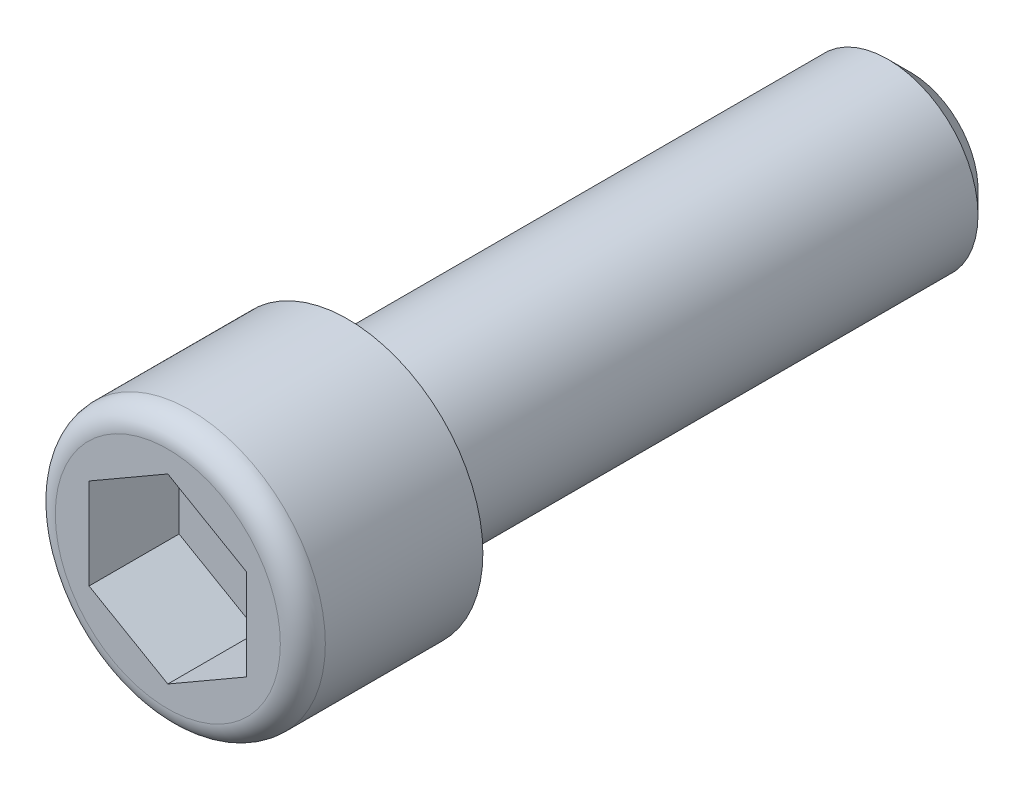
ISO-10303-21;
HEADER;
FILE_DESCRIPTION(('STEP AP214'),'2;1');
FILE_NAME('part.step','',(''),(''),'','','');
FILE_SCHEMA(('AUTOMOTIVE_DESIGN { 1 0 10303 214 1 1 1 1 }'));
ENDSEC;
DATA;
#1=APPLICATION_CONTEXT('core data for automotive mechanical design processes');
#2=APPLICATION_PROTOCOL_DEFINITION('international standard','automotive_design',2000,#1);
#3=PRODUCT_CONTEXT('',#1,'mechanical');
#4=PRODUCT('Part','Part','',(#3));
#5=PRODUCT_RELATED_PRODUCT_CATEGORY('part','',(#4));
#6=PRODUCT_DEFINITION_FORMATION('','',#4);
#7=PRODUCT_DEFINITION_CONTEXT('part definition',#1,'design');
#8=PRODUCT_DEFINITION('design','',#6,#7);
#9=PRODUCT_DEFINITION_SHAPE('','',#8);
#10=(LENGTH_UNIT() NAMED_UNIT(*) SI_UNIT(.MILLI.,.METRE.));
#11=(NAMED_UNIT(*) PLANE_ANGLE_UNIT() SI_UNIT($,.RADIAN.));
#12=(NAMED_UNIT(*) SI_UNIT($,.STERADIAN.) SOLID_ANGLE_UNIT());
#13=UNCERTAINTY_MEASURE_WITH_UNIT(LENGTH_MEASURE(1.E-05),#10,'distance_accuracy_value','');
#14=(GEOMETRIC_REPRESENTATION_CONTEXT(3) GLOBAL_UNCERTAINTY_ASSIGNED_CONTEXT((#13)) GLOBAL_UNIT_ASSIGNED_CONTEXT((#10,
#11,#12)) REPRESENTATION_CONTEXT('',''));
#15=CARTESIAN_POINT('',(0.,0.,0.));
#16=DIRECTION('',(0.,0.,1.));
#17=DIRECTION('',(1.,0.,0.));
#18=AXIS2_PLACEMENT_3D('',#15,#16,#17);
#19=CARTESIAN_POINT('',(0.,0.,-8.));
#20=DIRECTION('',(0.,0.,1.));
#21=DIRECTION('',(1.,0.,0.));
#22=AXIS2_PLACEMENT_3D('',#19,#20,#21);
#23=PLANE('',#22);
#24=CARTESIAN_POINT('',(0.,0.,-8.));
#25=DIRECTION('',(0.,0.,1.));
#26=DIRECTION('',(1.,0.,0.));
#27=AXIS2_PLACEMENT_3D('',#24,#25,#26);
#28=CIRCLE('',#27,6.);
#29=CARTESIAN_POINT('',(6.,0.,-8.));
#30=VERTEX_POINT('',#29);
#31=EDGE_CURVE('E134',#30,#30,#28,.T.);
#32=ORIENTED_EDGE('',*,*,#31,.F.);
#33=EDGE_LOOP('',(#32));
#34=FACE_BOUND('',#33,.T.);
#35=CARTESIAN_POINT('',(0.,0.,-8.));
#36=DIRECTION('',(0.,0.,1.));
#37=DIRECTION('',(1.,0.,0.));
#38=AXIS2_PLACEMENT_3D('',#35,#36,#37);
#39=CIRCLE('',#38,4.);
#40=CARTESIAN_POINT('',(4.,0.,-8.));
#41=VERTEX_POINT('',#40);
#42=EDGE_CURVE('E142',#41,#41,#39,.F.);
#43=ORIENTED_EDGE('',*,*,#42,.F.);
#44=EDGE_LOOP('',(#43));
#45=FACE_BOUND('',#44,.T.);
#46=ADVANCED_FACE('F32',(#34,#45),#23,.F.);
#47=CARTESIAN_POINT('',(0.,0.,-8.));
#48=DIRECTION('',(0.,0.,1.));
#49=DIRECTION('',(1.,0.,0.));
#50=AXIS2_PLACEMENT_3D('',#47,#48,#49);
#51=CYLINDRICAL_SURFACE('',#50,6.);
#52=CARTESIAN_POINT('',(0.,0.,-1.));
#53=DIRECTION('',(0.,0.,1.));
#54=DIRECTION('',(1.,0.,0.));
#55=AXIS2_PLACEMENT_3D('',#52,#53,#54);
#56=CIRCLE('',#55,6.);
#57=CARTESIAN_POINT('',(6.,0.,-1.));
#58=VERTEX_POINT('',#57);
#59=EDGE_CURVE('E11',#58,#58,#56,.F.);
#60=ORIENTED_EDGE('',*,*,#59,.T.);
#61=EDGE_LOOP('',(#60));
#62=FACE_BOUND('',#61,.T.);
#63=ORIENTED_EDGE('',*,*,#31,.T.);
#64=EDGE_LOOP('',(#63));
#65=FACE_BOUND('',#64,.T.);
#66=ADVANCED_FACE('F165',(#62,#65),#51,.T.);
#67=CARTESIAN_POINT('',(0.,0.,0.));
#68=DIRECTION('',(0.,0.,1.));
#69=DIRECTION('',(1.,0.,0.));
#70=AXIS2_PLACEMENT_3D('',#67,#68,#69);
#71=PLANE('',#70);
#72=CARTESIAN_POINT('',(0.,0.,0.));
#73=DIRECTION('',(0.,0.,1.));
#74=DIRECTION('',(1.,0.,0.));
#75=AXIS2_PLACEMENT_3D('',#72,#73,#74);
#76=CIRCLE('',#75,5.);
#77=CARTESIAN_POINT('',(5.,0.,0.));
#78=VERTEX_POINT('',#77);
#79=EDGE_CURVE('E40',#78,#78,#76,.T.);
#80=ORIENTED_EDGE('',*,*,#79,.T.);
#81=EDGE_LOOP('',(#80));
#82=FACE_BOUND('',#81,.T.);
#83=DIRECTION('',(0.,-1.,0.));
#84=VECTOR('',#83,1.);
#85=CARTESIAN_POINT('',(-3.5,2.02072594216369,0.));
#86=LINE('',#85,#84);
#87=CARTESIAN_POINT('',(-3.5,2.02072594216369,0.));
#88=VERTEX_POINT('',#87);
#89=CARTESIAN_POINT('',(-3.5,-2.02072594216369,0.));
#90=VERTEX_POINT('',#89);
#91=EDGE_CURVE('E47',#88,#90,#86,.T.);
#92=ORIENTED_EDGE('',*,*,#91,.F.);
#93=DIRECTION('',(-0.866025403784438,-0.5,0.));
#94=VECTOR('',#93,1.);
#95=CARTESIAN_POINT('',(0.,4.04145188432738,0.));
#96=LINE('',#95,#94);
#97=CARTESIAN_POINT('',(0.,4.04145188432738,0.));
#98=VERTEX_POINT('',#97);
#99=EDGE_CURVE('E130',#98,#88,#96,.T.);
#100=ORIENTED_EDGE('',*,*,#99,.F.);
#101=DIRECTION('',(-0.866025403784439,0.5,0.));
#102=VECTOR('',#101,1.);
#103=CARTESIAN_POINT('',(3.5,2.02072594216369,0.));
#104=LINE('',#103,#102);
#105=CARTESIAN_POINT('',(3.5,2.02072594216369,0.));
#106=VERTEX_POINT('',#105);
#107=EDGE_CURVE('E128',#106,#98,#104,.T.);
#108=ORIENTED_EDGE('',*,*,#107,.F.);
#109=DIRECTION('',(0.,1.,0.));
#110=VECTOR('',#109,1.);
#111=CARTESIAN_POINT('',(3.5,-2.02072594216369,0.));
#112=LINE('',#111,#110);
#113=CARTESIAN_POINT('',(3.5,-2.02072594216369,0.));
#114=VERTEX_POINT('',#113);
#115=EDGE_CURVE('E95',#114,#106,#112,.T.);
#116=ORIENTED_EDGE('',*,*,#115,.F.);
#117=DIRECTION('',(0.866025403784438,0.5,0.));
#118=VECTOR('',#117,1.);
#119=CARTESIAN_POINT('',(0.,-4.04145188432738,0.));
#120=LINE('',#119,#118);
#121=CARTESIAN_POINT('',(0.,-4.04145188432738,0.));
#122=VERTEX_POINT('',#121);
#123=EDGE_CURVE('E124',#122,#114,#120,.T.);
#124=ORIENTED_EDGE('',*,*,#123,.F.);
#125=DIRECTION('',(0.866025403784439,-0.5,0.));
#126=VECTOR('',#125,1.);
#127=CARTESIAN_POINT('',(-3.5,-2.02072594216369,0.));
#128=LINE('',#127,#126);
#129=EDGE_CURVE('E121',#90,#122,#128,.T.);
#130=ORIENTED_EDGE('',*,*,#129,.F.);
#131=EDGE_LOOP('',(#92,#100,#108,#116,#124,#130));
#132=FACE_BOUND('',#131,.T.);
#133=ADVANCED_FACE('F153',(#82,#132),#71,.T.);
#134=CARTESIAN_POINT('',(0.,0.,-33.));
#135=DIRECTION('',(0.,0.,1.));
#136=DIRECTION('',(1.,0.,0.));
#137=AXIS2_PLACEMENT_3D('',#134,#135,#136);
#138=CYLINDRICAL_SURFACE('',#137,4.);
#139=CARTESIAN_POINT('',(0.,0.,-32.));
#140=DIRECTION('',(0.,0.,-1.));
#141=DIRECTION('',(-1.,0.,0.));
#142=AXIS2_PLACEMENT_3D('',#139,#140,#141);
#143=CIRCLE('',#142,4.);
#144=CARTESIAN_POINT('',(-4.,0.,-32.));
#145=VERTEX_POINT('',#144);
#146=EDGE_CURVE('E148',#145,#145,#143,.F.);
#147=ORIENTED_EDGE('',*,*,#146,.T.);
#148=EDGE_LOOP('',(#147));
#149=FACE_BOUND('',#148,.T.);
#150=ORIENTED_EDGE('',*,*,#42,.T.);
#151=EDGE_LOOP('',(#150));
#152=FACE_BOUND('',#151,.T.);
#153=ADVANCED_FACE('F177',(#149,#152),#138,.T.);
#154=CARTESIAN_POINT('',(0.,0.,-33.));
#155=DIRECTION('',(0.,0.,-1.));
#156=DIRECTION('',(-1.,0.,0.));
#157=AXIS2_PLACEMENT_3D('',#154,#155,#156);
#158=PLANE('',#157);
#159=CARTESIAN_POINT('',(0.,0.,-33.));
#160=DIRECTION('',(0.,0.,-1.));
#161=DIRECTION('',(-1.,0.,0.));
#162=AXIS2_PLACEMENT_3D('',#159,#160,#161);
#163=CIRCLE('',#162,3.);
#164=CARTESIAN_POINT('',(-3.,0.,-33.));
#165=VERTEX_POINT('',#164);
#166=EDGE_CURVE('E145',#165,#165,#163,.T.);
#167=ORIENTED_EDGE('',*,*,#166,.T.);
#168=EDGE_LOOP('',(#167));
#169=FACE_BOUND('',#168,.T.);
#170=ADVANCED_FACE('F183',(#169),#158,.T.);
#171=CARTESIAN_POINT('',(0.,0.,-33.));
#172=DIRECTION('',(0.,0.,1.));
#173=DIRECTION('',(1.,0.,0.));
#174=AXIS2_PLACEMENT_3D('',#171,#172,#173);
#175=CONICAL_SURFACE('',#174,3.,0.785398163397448);
#176=ORIENTED_EDGE('',*,*,#146,.F.);
#177=EDGE_LOOP('',(#176));
#178=FACE_BOUND('',#177,.T.);
#179=ORIENTED_EDGE('',*,*,#166,.F.);
#180=EDGE_LOOP('',(#179));
#181=FACE_BOUND('',#180,.T.);
#182=ADVANCED_FACE('F180',(#178,#181),#175,.T.);
#183=CARTESIAN_POINT('',(-3.5,2.02072594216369,-4.));
#184=DIRECTION('',(-1.,0.,0.));
#185=DIRECTION('',(0.,-1.,0.));
#186=AXIS2_PLACEMENT_3D('',#183,#184,#185);
#187=PLANE('',#186);
#188=ORIENTED_EDGE('',*,*,#91,.T.);
#189=DIRECTION('',(0.,0.,1.));
#190=VECTOR('',#189,1.);
#191=CARTESIAN_POINT('',(-3.5,-2.02072594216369,-4.));
#192=LINE('',#191,#190);
#193=CARTESIAN_POINT('',(-3.5,-2.02072594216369,-4.));
#194=VERTEX_POINT('',#193);
#195=EDGE_CURVE('E77',#194,#90,#192,.T.);
#196=ORIENTED_EDGE('',*,*,#195,.F.);
#197=DIRECTION('',(0.,-1.,0.));
#198=VECTOR('',#197,1.);
#199=CARTESIAN_POINT('',(-3.5,2.02072594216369,-4.));
#200=LINE('',#199,#198);
#201=CARTESIAN_POINT('',(-3.5,2.02072594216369,-4.));
#202=VERTEX_POINT('',#201);
#203=EDGE_CURVE('E132',#202,#194,#200,.T.);
#204=ORIENTED_EDGE('',*,*,#203,.F.);
#205=DIRECTION('',(0.,0.,1.));
#206=VECTOR('',#205,1.);
#207=CARTESIAN_POINT('',(-3.5,2.02072594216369,-4.));
#208=LINE('',#207,#206);
#209=EDGE_CURVE('E55',#202,#88,#208,.T.);
#210=ORIENTED_EDGE('',*,*,#209,.T.);
#211=EDGE_LOOP('',(#188,#196,#204,#210));
#212=FACE_BOUND('',#211,.T.);
#213=ADVANCED_FACE('F182',(#212),#187,.F.);
#214=CARTESIAN_POINT('',(0.,4.04145188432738,-4.));
#215=DIRECTION('',(-0.5,0.866025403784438,0.));
#216=DIRECTION('',(-0.866025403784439,-0.5,0.));
#217=AXIS2_PLACEMENT_3D('',#214,#215,#216);
#218=PLANE('',#217);
#219=ORIENTED_EDGE('',*,*,#99,.T.);
#220=ORIENTED_EDGE('',*,*,#209,.F.);
#221=DIRECTION('',(-0.866025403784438,-0.5,0.));
#222=VECTOR('',#221,1.);
#223=CARTESIAN_POINT('',(0.,4.04145188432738,-4.));
#224=LINE('',#223,#222);
#225=CARTESIAN_POINT('',(0.,4.04145188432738,-4.));
#226=VERTEX_POINT('',#225);
#227=EDGE_CURVE('E107',#226,#202,#224,.T.);
#228=ORIENTED_EDGE('',*,*,#227,.F.);
#229=DIRECTION('',(0.,0.,1.));
#230=VECTOR('',#229,1.);
#231=CARTESIAN_POINT('',(0.,4.04145188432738,-4.));
#232=LINE('',#231,#230);
#233=EDGE_CURVE('E99',#226,#98,#232,.T.);
#234=ORIENTED_EDGE('',*,*,#233,.T.);
#235=EDGE_LOOP('',(#219,#220,#228,#234));
#236=FACE_BOUND('',#235,.T.);
#237=ADVANCED_FACE('F189',(#236),#218,.F.);
#238=CARTESIAN_POINT('',(3.5,2.02072594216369,-4.));
#239=DIRECTION('',(0.5,0.866025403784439,0.));
#240=DIRECTION('',(-0.866025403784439,0.5,0.));
#241=AXIS2_PLACEMENT_3D('',#238,#239,#240);
#242=PLANE('',#241);
#243=ORIENTED_EDGE('',*,*,#107,.T.);
#244=ORIENTED_EDGE('',*,*,#233,.F.);
#245=DIRECTION('',(-0.866025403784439,0.5,0.));
#246=VECTOR('',#245,1.);
#247=CARTESIAN_POINT('',(3.5,2.02072594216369,-4.));
#248=LINE('',#247,#246);
#249=CARTESIAN_POINT('',(3.5,2.02072594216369,-4.));
#250=VERTEX_POINT('',#249);
#251=EDGE_CURVE('E103',#250,#226,#248,.T.);
#252=ORIENTED_EDGE('',*,*,#251,.F.);
#253=DIRECTION('',(0.,0.,1.));
#254=VECTOR('',#253,1.);
#255=CARTESIAN_POINT('',(3.5,2.02072594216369,-4.));
#256=LINE('',#255,#254);
#257=EDGE_CURVE('E88',#250,#106,#256,.T.);
#258=ORIENTED_EDGE('',*,*,#257,.T.);
#259=EDGE_LOOP('',(#243,#244,#252,#258));
#260=FACE_BOUND('',#259,.T.);
#261=ADVANCED_FACE('F104',(#260),#242,.F.);
#262=CARTESIAN_POINT('',(3.5,-2.02072594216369,-4.));
#263=DIRECTION('',(1.,0.,0.));
#264=DIRECTION('',(0.,0.,-1.));
#265=AXIS2_PLACEMENT_3D('',#262,#263,#264);
#266=PLANE('',#265);
#267=ORIENTED_EDGE('',*,*,#115,.T.);
#268=ORIENTED_EDGE('',*,*,#257,.F.);
#269=DIRECTION('',(0.,1.,0.));
#270=VECTOR('',#269,1.);
#271=CARTESIAN_POINT('',(3.5,-2.02072594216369,-4.));
#272=LINE('',#271,#270);
#273=CARTESIAN_POINT('',(3.5,-2.02072594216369,-4.));
#274=VERTEX_POINT('',#273);
#275=EDGE_CURVE('E92',#274,#250,#272,.T.);
#276=ORIENTED_EDGE('',*,*,#275,.F.);
#277=DIRECTION('',(0.,0.,1.));
#278=VECTOR('',#277,1.);
#279=CARTESIAN_POINT('',(3.5,-2.02072594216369,-4.));
#280=LINE('',#279,#278);
#281=EDGE_CURVE('E100',#274,#114,#280,.T.);
#282=ORIENTED_EDGE('',*,*,#281,.T.);
#283=EDGE_LOOP('',(#267,#268,#276,#282));
#284=FACE_BOUND('',#283,.T.);
#285=ADVANCED_FACE('F90',(#284),#266,.F.);
#286=CARTESIAN_POINT('',(0.,-4.04145188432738,-4.));
#287=DIRECTION('',(0.5,-0.866025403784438,0.));
#288=DIRECTION('',(0.866025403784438,0.5,0.));
#289=AXIS2_PLACEMENT_3D('',#286,#287,#288);
#290=PLANE('',#289);
#291=ORIENTED_EDGE('',*,*,#123,.T.);
#292=ORIENTED_EDGE('',*,*,#281,.F.);
#293=DIRECTION('',(0.866025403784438,0.5,0.));
#294=VECTOR('',#293,1.);
#295=CARTESIAN_POINT('',(0.,-4.04145188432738,-4.));
#296=LINE('',#295,#294);
#297=CARTESIAN_POINT('',(0.,-4.04145188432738,-4.));
#298=VERTEX_POINT('',#297);
#299=EDGE_CURVE('E113',#298,#274,#296,.T.);
#300=ORIENTED_EDGE('',*,*,#299,.F.);
#301=DIRECTION('',(0.,0.,1.));
#302=VECTOR('',#301,1.);
#303=CARTESIAN_POINT('',(0.,-4.04145188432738,-4.));
#304=LINE('',#303,#302);
#305=EDGE_CURVE('E137',#298,#122,#304,.T.);
#306=ORIENTED_EDGE('',*,*,#305,.T.);
#307=EDGE_LOOP('',(#291,#292,#300,#306));
#308=FACE_BOUND('',#307,.T.);
#309=ADVANCED_FACE('F242',(#308),#290,.F.);
#310=CARTESIAN_POINT('',(-3.5,-2.02072594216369,-4.));
#311=DIRECTION('',(-0.5,-0.866025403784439,0.));
#312=DIRECTION('',(0.866025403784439,-0.5,0.));
#313=AXIS2_PLACEMENT_3D('',#310,#311,#312);
#314=PLANE('',#313);
#315=ORIENTED_EDGE('',*,*,#129,.T.);
#316=ORIENTED_EDGE('',*,*,#305,.F.);
#317=DIRECTION('',(0.866025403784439,-0.5,0.));
#318=VECTOR('',#317,1.);
#319=CARTESIAN_POINT('',(-3.5,-2.02072594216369,-4.));
#320=LINE('',#319,#318);
#321=EDGE_CURVE('E115',#194,#298,#320,.T.);
#322=ORIENTED_EDGE('',*,*,#321,.F.);
#323=ORIENTED_EDGE('',*,*,#195,.T.);
#324=EDGE_LOOP('',(#315,#316,#322,#323));
#325=FACE_BOUND('',#324,.T.);
#326=ADVANCED_FACE('F161',(#325),#314,.F.);
#327=CARTESIAN_POINT('',(-3.5,6.06217782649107,-4.));
#328=DIRECTION('',(0.,0.,-1.));
#329=DIRECTION('',(-1.,0.,0.));
#330=AXIS2_PLACEMENT_3D('',#327,#328,#329);
#331=PLANE('',#330);
#332=ORIENTED_EDGE('',*,*,#203,.T.);
#333=ORIENTED_EDGE('',*,*,#321,.T.);
#334=ORIENTED_EDGE('',*,*,#299,.T.);
#335=ORIENTED_EDGE('',*,*,#275,.T.);
#336=ORIENTED_EDGE('',*,*,#251,.T.);
#337=ORIENTED_EDGE('',*,*,#227,.T.);
#338=EDGE_LOOP('',(#332,#333,#334,#335,#336,#337));
#339=FACE_BOUND('',#338,.T.);
#340=ADVANCED_FACE('F110',(#339),#331,.F.);
#341=CARTESIAN_POINT('',(0.,0.,-1.));
#342=DIRECTION('',(0.,0.,1.));
#343=DIRECTION('',(1.,0.,0.));
#344=AXIS2_PLACEMENT_3D('',#341,#342,#343);
#345=TOROIDAL_SURFACE('',#344,5.,1.);
#346=ORIENTED_EDGE('',*,*,#59,.F.);
#347=EDGE_LOOP('',(#346));
#348=FACE_BOUND('',#347,.T.);
#349=ORIENTED_EDGE('',*,*,#79,.F.);
#350=EDGE_LOOP('',(#349));
#351=FACE_BOUND('',#350,.T.);
#352=ADVANCED_FACE('F34',(#348,#351),#345,.T.);
#353=CLOSED_SHELL('',(#46,#66,#133,#153,#170,#182,#213,#237,#261,#285,#309,#326,#340,#352));
#354=MANIFOLD_SOLID_BREP('B2',#353);
#355=ADVANCED_BREP_SHAPE_REPRESENTATION('',(#18,#354),#14);
#356=SHAPE_DEFINITION_REPRESENTATION(#9,#355);
ENDSEC;
END-ISO-10303-21;
